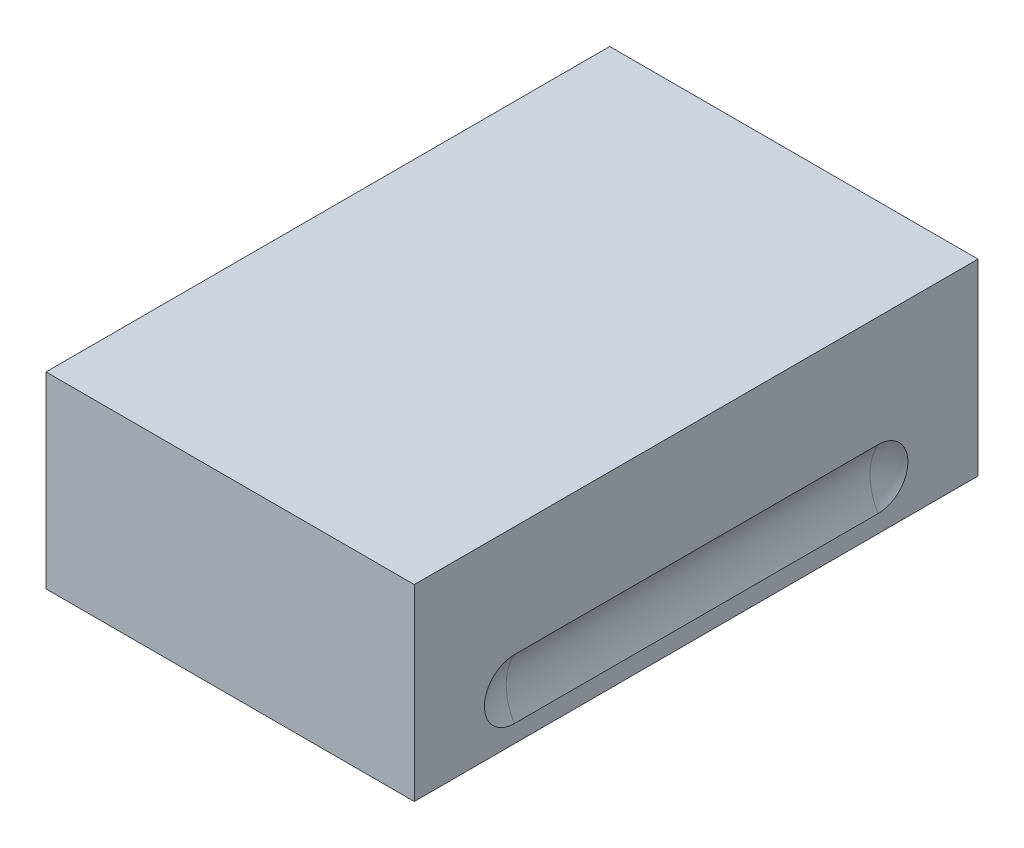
ISO-10303-21;
HEADER;
FILE_DESCRIPTION(('STEP AP214'),'2;1');
FILE_NAME('part.step','',(''),(''),'','','');
FILE_SCHEMA(('AUTOMOTIVE_DESIGN { 1 0 10303 214 1 1 1 1 }'));
ENDSEC;
DATA;
#1=APPLICATION_CONTEXT('core data for automotive mechanical design processes');
#2=APPLICATION_PROTOCOL_DEFINITION('international standard','automotive_design',2000,#1);
#3=PRODUCT_CONTEXT('',#1,'mechanical');
#4=PRODUCT('Part','Part','',(#3));
#5=PRODUCT_RELATED_PRODUCT_CATEGORY('part','',(#4));
#6=PRODUCT_DEFINITION_FORMATION('','',#4);
#7=PRODUCT_DEFINITION_CONTEXT('part definition',#1,'design');
#8=PRODUCT_DEFINITION('design','',#6,#7);
#9=PRODUCT_DEFINITION_SHAPE('','',#8);
#10=(LENGTH_UNIT() NAMED_UNIT(*) SI_UNIT(.MILLI.,.METRE.));
#11=(NAMED_UNIT(*) PLANE_ANGLE_UNIT() SI_UNIT($,.RADIAN.));
#12=(NAMED_UNIT(*) SI_UNIT($,.STERADIAN.) SOLID_ANGLE_UNIT());
#13=UNCERTAINTY_MEASURE_WITH_UNIT(LENGTH_MEASURE(1.E-05),#10,'distance_accuracy_value','');
#14=(GEOMETRIC_REPRESENTATION_CONTEXT(3) GLOBAL_UNCERTAINTY_ASSIGNED_CONTEXT((#13)) GLOBAL_UNIT_ASSIGNED_CONTEXT((#10,
#11,#12)) REPRESENTATION_CONTEXT('',''));
#15=CARTESIAN_POINT('',(0.,0.,0.));
#16=DIRECTION('',(0.,0.,1.));
#17=DIRECTION('',(1.,0.,0.));
#18=AXIS2_PLACEMENT_3D('',#15,#16,#17);
#19=CARTESIAN_POINT('',(0.,58.5,-87.5));
#20=DIRECTION('',(0.,1.,0.));
#21=DIRECTION('',(0.,0.,1.));
#22=AXIS2_PLACEMENT_3D('',#19,#20,#21);
#23=PLANE('',#22);
#24=DIRECTION('',(0.,0.,1.));
#25=VECTOR('',#24,1.);
#26=CARTESIAN_POINT('',(-8.25,58.5,-64.5));
#27=LINE('',#26,#25);
#28=CARTESIAN_POINT('',(-8.25,58.5,-64.5));
#29=VERTEX_POINT('',#28);
#30=CARTESIAN_POINT('',(-8.25,58.5,-110.5));
#31=VERTEX_POINT('',#30);
#32=EDGE_CURVE('E273',#29,#31,#27,.F.);
#33=ORIENTED_EDGE('',*,*,#32,.T.);
#34=DIRECTION('',(-1.,0.,0.));
#35=VECTOR('',#34,1.);
#36=CARTESIAN_POINT('',(-8.25,58.5,-110.5));
#37=LINE('',#36,#35);
#38=CARTESIAN_POINT('',(8.25,58.5,-110.5));
#39=VERTEX_POINT('',#38);
#40=EDGE_CURVE('E272',#31,#39,#37,.F.);
#41=ORIENTED_EDGE('',*,*,#40,.T.);
#42=DIRECTION('',(0.,0.,-1.));
#43=VECTOR('',#42,1.);
#44=CARTESIAN_POINT('',(8.25,58.5,-110.5));
#45=LINE('',#44,#43);
#46=CARTESIAN_POINT('',(8.25,58.5,-64.5));
#47=VERTEX_POINT('',#46);
#48=EDGE_CURVE('E280',#39,#47,#45,.F.);
#49=ORIENTED_EDGE('',*,*,#48,.T.);
#50=DIRECTION('',(1.,0.,0.));
#51=VECTOR('',#50,1.);
#52=CARTESIAN_POINT('',(8.25,58.5,-64.5));
#53=LINE('',#52,#51);
#54=EDGE_CURVE('E285',#47,#29,#53,.F.);
#55=ORIENTED_EDGE('',*,*,#54,.T.);
#56=EDGE_LOOP('',(#33,#41,#49,#55));
#57=FACE_BOUND('',#56,.T.);
#58=ADVANCED_FACE('F14',(#57),#23,.F.);
#59=CARTESIAN_POINT('',(-8.25,50.,-64.5));
#60=DIRECTION('',(-1.,0.,0.));
#61=DIRECTION('',(0.,0.,1.));
#62=AXIS2_PLACEMENT_3D('',#59,#60,#61);
#63=PLANE('',#62);
#64=DIRECTION('',(0.,1.,0.));
#65=VECTOR('',#64,1.);
#66=CARTESIAN_POINT('',(-8.25,50.,-110.5));
#67=LINE('',#66,#65);
#68=CARTESIAN_POINT('',(-8.25,50.,-110.5));
#69=VERTEX_POINT('',#68);
#70=EDGE_CURVE('E264',#69,#31,#67,.T.);
#71=ORIENTED_EDGE('',*,*,#70,.T.);
#72=ORIENTED_EDGE('',*,*,#32,.F.);
#73=DIRECTION('',(0.,1.,0.));
#74=VECTOR('',#73,1.);
#75=CARTESIAN_POINT('',(-8.25,50.,-64.5));
#76=LINE('',#75,#74);
#77=CARTESIAN_POINT('',(-8.25,50.,-64.5));
#78=VERTEX_POINT('',#77);
#79=EDGE_CURVE('E80',#29,#78,#76,.F.);
#80=ORIENTED_EDGE('',*,*,#79,.T.);
#81=DIRECTION('',(0.,0.,1.));
#82=VECTOR('',#81,1.);
#83=CARTESIAN_POINT('',(-8.25,50.,-87.5));
#84=LINE('',#83,#82);
#85=EDGE_CURVE('E220',#78,#69,#84,.F.);
#86=ORIENTED_EDGE('',*,*,#85,.T.);
#87=EDGE_LOOP('',(#71,#72,#80,#86));
#88=FACE_BOUND('',#87,.T.);
#89=ADVANCED_FACE('F261',(#88),#63,.F.);
#90=CARTESIAN_POINT('',(-8.25,50.,-110.5));
#91=DIRECTION('',(0.,0.,-1.));
#92=DIRECTION('',(-1.,0.,0.));
#93=AXIS2_PLACEMENT_3D('',#90,#91,#92);
#94=PLANE('',#93);
#95=DIRECTION('',(0.,1.,0.));
#96=VECTOR('',#95,1.);
#97=CARTESIAN_POINT('',(8.25,50.,-110.5));
#98=LINE('',#97,#96);
#99=CARTESIAN_POINT('',(8.25,50.,-110.5));
#100=VERTEX_POINT('',#99);
#101=EDGE_CURVE('E275',#100,#39,#98,.T.);
#102=ORIENTED_EDGE('',*,*,#101,.T.);
#103=ORIENTED_EDGE('',*,*,#40,.F.);
#104=ORIENTED_EDGE('',*,*,#70,.F.);
#105=DIRECTION('',(1.,0.,0.));
#106=VECTOR('',#105,1.);
#107=CARTESIAN_POINT('',(0.,50.,-110.5));
#108=LINE('',#107,#106);
#109=EDGE_CURVE('E223',#69,#100,#108,.T.);
#110=ORIENTED_EDGE('',*,*,#109,.T.);
#111=EDGE_LOOP('',(#102,#103,#104,#110));
#112=FACE_BOUND('',#111,.T.);
#113=ADVANCED_FACE('F270',(#112),#94,.F.);
#114=CARTESIAN_POINT('',(8.25,50.,-110.5));
#115=DIRECTION('',(1.,0.,0.));
#116=DIRECTION('',(0.,0.,-1.));
#117=AXIS2_PLACEMENT_3D('',#114,#115,#116);
#118=PLANE('',#117);
#119=DIRECTION('',(0.,1.,0.));
#120=VECTOR('',#119,1.);
#121=CARTESIAN_POINT('',(8.25,50.,-64.5));
#122=LINE('',#121,#120);
#123=CARTESIAN_POINT('',(8.25,50.,-64.5));
#124=VERTEX_POINT('',#123);
#125=EDGE_CURVE('E252',#124,#47,#122,.T.);
#126=ORIENTED_EDGE('',*,*,#125,.T.);
#127=ORIENTED_EDGE('',*,*,#48,.F.);
#128=ORIENTED_EDGE('',*,*,#101,.F.);
#129=DIRECTION('',(0.,0.,1.));
#130=VECTOR('',#129,1.);
#131=CARTESIAN_POINT('',(8.25,50.,-87.5));
#132=LINE('',#131,#130);
#133=EDGE_CURVE('E235',#100,#124,#132,.T.);
#134=ORIENTED_EDGE('',*,*,#133,.T.);
#135=EDGE_LOOP('',(#126,#127,#128,#134));
#136=FACE_BOUND('',#135,.T.);
#137=ADVANCED_FACE('F291',(#136),#118,.F.);
#138=CARTESIAN_POINT('',(8.25,50.,-64.5));
#139=DIRECTION('',(0.,0.,1.));
#140=DIRECTION('',(1.,0.,0.));
#141=AXIS2_PLACEMENT_3D('',#138,#139,#140);
#142=PLANE('',#141);
#143=ORIENTED_EDGE('',*,*,#79,.F.);
#144=ORIENTED_EDGE('',*,*,#54,.F.);
#145=ORIENTED_EDGE('',*,*,#125,.F.);
#146=DIRECTION('',(1.,0.,0.));
#147=VECTOR('',#146,1.);
#148=CARTESIAN_POINT('',(0.,50.,-64.5));
#149=LINE('',#148,#147);
#150=EDGE_CURVE('E93',#124,#78,#149,.F.);
#151=ORIENTED_EDGE('',*,*,#150,.T.);
#152=EDGE_LOOP('',(#143,#144,#145,#151));
#153=FACE_BOUND('',#152,.T.);
#154=ADVANCED_FACE('F248',(#153),#142,.F.);
#155=CARTESIAN_POINT('',(31.3299999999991,56.3,-63.2999999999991));
#156=DIRECTION('',(0.880737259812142,0.442113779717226,0.169815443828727));
#157=DIRECTION('',(0.469386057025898,-0.767096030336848,-0.437310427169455));
#158=AXIS2_PLACEMENT_3D('',#155,#156,#157);
#159=SPHERICAL_SURFACE('',#158,7.9);
#160=CARTESIAN_POINT('',(31.33,56.3,-63.3));
#161=DIRECTION('',(0.,0.,-1.));
#162=DIRECTION('',(-1.,0.,0.));
#163=AXIS2_PLACEMENT_3D('',#160,#161,#162);
#164=CIRCLE('',#163,7.9);
#165=CARTESIAN_POINT('',(24.5,52.3299748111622,-63.3));
#166=VERTEX_POINT('',#165);
#167=CARTESIAN_POINT('',(24.5,60.270025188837,-63.3));
#168=VERTEX_POINT('',#167);
#169=EDGE_CURVE('E18',#166,#168,#164,.T.);
#170=ORIENTED_EDGE('',*,*,#169,.T.);
#171=CARTESIAN_POINT('',(24.5,52.3299748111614,-63.3));
#172=CARTESIAN_POINT('',(24.5,52.32996411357,-63.188339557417));
#173=CARTESIAN_POINT('',(24.5,52.3346855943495,-63.0766841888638));
#174=CARTESIAN_POINT('',(24.5,52.3535101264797,-62.85417227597));
#175=CARTESIAN_POINT('',(24.5,52.3676127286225,-62.7433156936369));
#176=CARTESIAN_POINT('',(24.5,52.4051035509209,-62.5232565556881));
#177=CARTESIAN_POINT('',(24.5,52.4284852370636,-62.414052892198));
#178=CARTESIAN_POINT('',(24.5,52.4843445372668,-62.1980301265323));
#179=CARTESIAN_POINT('',(24.5,52.5168220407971,-62.0912109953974));
#180=CARTESIAN_POINT('',(24.5,52.627634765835,-61.775364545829));
#181=CARTESIAN_POINT('',(24.5,52.7193661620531,-61.5708549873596));
#182=CARTESIAN_POINT('',(24.5,52.9357981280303,-61.1802936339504));
#183=CARTESIAN_POINT('',(24.5,53.0604922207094,-60.9942382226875));
#184=CARTESIAN_POINT('',(24.5,53.339358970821,-60.6456655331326));
#185=CARTESIAN_POINT('',(24.5,53.493532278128,-60.4831487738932));
#186=CARTESIAN_POINT('',(24.5,53.8269954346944,-60.1862886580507));
#187=CARTESIAN_POINT('',(24.5,54.0062891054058,-60.0519495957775));
#188=CARTESIAN_POINT('',(24.5,54.3848790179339,-59.8152846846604));
#189=CARTESIAN_POINT('',(24.5,54.5841743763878,-59.7129574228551));
#190=CARTESIAN_POINT('',(24.5,54.9971025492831,-59.5432212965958));
#191=CARTESIAN_POINT('',(24.5,55.210734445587,-59.4758101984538));
#192=CARTESIAN_POINT('',(24.5,55.6462877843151,-59.3778081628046));
#193=CARTESIAN_POINT('',(24.5,55.8682093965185,-59.3472179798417));
#194=CARTESIAN_POINT('',(24.5,56.3140435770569,-59.3237286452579));
#195=CARTESIAN_POINT('',(24.5,56.5379561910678,-59.3308303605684));
#196=CARTESIAN_POINT('',(24.5,56.981408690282,-59.3825247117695));
#197=CARTESIAN_POINT('',(24.5,57.2009486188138,-59.4271169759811));
#198=CARTESIAN_POINT('',(24.5,57.6294255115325,-59.5525266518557));
#199=CARTESIAN_POINT('',(24.5,57.8383625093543,-59.6333439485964));
#200=CARTESIAN_POINT('',(24.5,58.2397074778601,-59.8289092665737));
#201=CARTESIAN_POINT('',(24.5,58.4321150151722,-59.943658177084));
#202=CARTESIAN_POINT('',(24.5,58.7949275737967,-60.2038324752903));
#203=CARTESIAN_POINT('',(24.5,58.9653336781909,-60.3492563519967));
#204=CARTESIAN_POINT('',(24.5,59.2792822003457,-60.6665954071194));
#205=CARTESIAN_POINT('',(24.5,59.4228282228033,-60.8385070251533));
#206=CARTESIAN_POINT('',(24.5,59.679104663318,-61.2041616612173));
#207=CARTESIAN_POINT('',(24.5,59.7918252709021,-61.3979116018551));
#208=CARTESIAN_POINT('',(24.5,59.9352824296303,-61.7005119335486));
#209=CARTESIAN_POINT('',(24.5,59.9788567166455,-61.8034663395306));
#210=CARTESIAN_POINT('',(24.5,60.0571708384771,-62.0126704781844));
#211=CARTESIAN_POINT('',(24.5,60.0919139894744,-62.1189189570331));
#212=CARTESIAN_POINT('',(24.5,60.1522829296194,-62.3338378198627));
#213=CARTESIAN_POINT('',(24.5,60.1779187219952,-62.4425054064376));
#214=CARTESIAN_POINT('',(24.5,60.2199409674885,-62.6615720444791));
#215=CARTESIAN_POINT('',(24.5,60.2363319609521,-62.7719702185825));
#216=CARTESIAN_POINT('',(24.5,60.2553736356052,-62.9521737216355));
#217=CARTESIAN_POINT('',(24.5,60.260871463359,-63.02169076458));
#218=CARTESIAN_POINT('',(24.5,60.2681945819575,-63.1608027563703));
#219=CARTESIAN_POINT('',(24.5,60.27002592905,-63.230397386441));
#220=CARTESIAN_POINT('',(24.5,60.2700251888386,-63.3));
#221=B_SPLINE_CURVE_WITH_KNOTS('',3,(#171,#172,#173,#174,#175,#176,#177,#178,#179,#180,#181,
#182,#183,#184,#185,#186,#187,#188,#189,#190,#191,#192,#193,#194,#195,#196,#197,#198,#199,#200,
#201,#202,#203,#204,#205,#206,#207,#208,#209,#210,#211,#212,#213,#214,#215,#216,#217,#218,#219,
#220),.UNSPECIFIED.,.F.,.F.,(4,2,2,2,2,2,2,2,2,2,2,2,2,2,2,2,2,2,2,2,2,2,2,2,4),(0.,
0.334872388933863,0.66972874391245,1.00434972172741,1.33896663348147,2.00792040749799,
2.6767428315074,3.34558000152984,4.01451902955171,4.68342852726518,5.3522952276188,
6.02117563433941,6.69007142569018,7.35896058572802,8.02784762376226,8.69675219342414,
9.36562382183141,10.0344056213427,10.7034000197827,11.0384618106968,11.3733975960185,
11.7079643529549,12.0423666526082,12.2514802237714,12.4602480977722),.UNSPECIFIED.);
#222=EDGE_CURVE('E77',#166,#168,#221,.T.);
#223=ORIENTED_EDGE('',*,*,#222,.F.);
#224=EDGE_LOOP('',(#170,#223));
#225=FACE_BOUND('',#224,.T.);
#226=ADVANCED_FACE('F75',(#225),#159,.F.);
#227=CARTESIAN_POINT('',(31.33,56.3,-87.5));
#228=DIRECTION('',(0.,0.,-1.));
#229=DIRECTION('',(-1.,0.,0.));
#230=AXIS2_PLACEMENT_3D('',#227,#228,#229);
#231=CYLINDRICAL_SURFACE('',#230,7.9);
#232=ORIENTED_EDGE('',*,*,#169,.F.);
#233=DIRECTION('',(0.,0.,-1.));
#234=VECTOR('',#233,1.);
#235=CARTESIAN_POINT('',(24.5,52.329974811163,-125.));
#236=LINE('',#235,#234);
#237=CARTESIAN_POINT('',(24.5,52.329974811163,-111.7));
#238=VERTEX_POINT('',#237);
#239=EDGE_CURVE('E91',#238,#166,#236,.F.);
#240=ORIENTED_EDGE('',*,*,#239,.F.);
#241=CARTESIAN_POINT('',(31.33,56.3,-111.7));
#242=DIRECTION('',(0.,0.,-1.));
#243=DIRECTION('',(-1.,0.,0.));
#244=AXIS2_PLACEMENT_3D('',#241,#242,#243);
#245=CIRCLE('',#244,7.9);
#246=CARTESIAN_POINT('',(24.5,60.2700251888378,-111.7));
#247=VERTEX_POINT('',#246);
#248=EDGE_CURVE('E79',#238,#247,#245,.T.);
#249=ORIENTED_EDGE('',*,*,#248,.T.);
#250=DIRECTION('',(0.,0.,-1.));
#251=VECTOR('',#250,1.);
#252=CARTESIAN_POINT('',(24.5,60.270025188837,-125.));
#253=LINE('',#252,#251);
#254=EDGE_CURVE('E82',#168,#247,#253,.T.);
#255=ORIENTED_EDGE('',*,*,#254,.F.);
#256=EDGE_LOOP('',(#232,#240,#249,#255));
#257=FACE_BOUND('',#256,.T.);
#258=ADVANCED_FACE('F83',(#257),#231,.F.);
#259=CARTESIAN_POINT('',(31.3299999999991,56.3,-111.7));
#260=DIRECTION('',(0.880737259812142,0.442113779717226,0.169815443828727));
#261=DIRECTION('',(0.469386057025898,-0.767096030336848,-0.437310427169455));
#262=AXIS2_PLACEMENT_3D('',#259,#260,#261);
#263=SPHERICAL_SURFACE('',#262,7.9);
#264=CARTESIAN_POINT('',(24.3721756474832,52.8073011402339,-113.041542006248));
#265=VERTEX_POINT('',#264);
#266=VERTEX_LOOP('',#265);
#267=FACE_BOUND('',#266,.T.);
#268=ORIENTED_EDGE('',*,*,#248,.F.);
#269=CARTESIAN_POINT('',(24.5,60.2700251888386,-111.7));
#270=CARTESIAN_POINT('',(24.5,60.2700358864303,-111.811660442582));
#271=CARTESIAN_POINT('',(24.5,60.2653144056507,-111.923315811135));
#272=CARTESIAN_POINT('',(24.5,60.2464898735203,-112.145827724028));
#273=CARTESIAN_POINT('',(24.5,60.2323872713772,-112.256684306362));
#274=CARTESIAN_POINT('',(24.5,60.1948964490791,-112.476743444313));
#275=CARTESIAN_POINT('',(24.5,60.1715147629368,-112.585947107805));
#276=CARTESIAN_POINT('',(24.5,60.1156554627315,-112.801969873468));
#277=CARTESIAN_POINT('',(24.5,60.083177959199,-112.908789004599));
#278=CARTESIAN_POINT('',(24.5,59.9723652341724,-113.22463545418));
#279=CARTESIAN_POINT('',(24.5,59.8806338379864,-113.429145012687));
#280=CARTESIAN_POINT('',(24.5,59.6642018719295,-113.819706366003));
#281=CARTESIAN_POINT('',(24.5,59.5395077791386,-114.005761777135));
#282=CARTESIAN_POINT('',(24.5,59.260641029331,-114.354334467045));
#283=CARTESIAN_POINT('',(24.5,59.1064677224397,-114.516851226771));
#284=CARTESIAN_POINT('',(24.5,58.7730045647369,-114.813711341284));
#285=CARTESIAN_POINT('',(24.5,58.593710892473,-114.948050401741));
#286=CARTESIAN_POINT('',(24.5,58.2151209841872,-115.184715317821));
#287=CARTESIAN_POINT('',(24.5,58.0158256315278,-115.287042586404));
#288=CARTESIAN_POINT('',(24.5,57.6028974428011,-115.456778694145));
#289=CARTESIAN_POINT('',(24.5,57.3892655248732,-115.524189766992));
#290=CARTESIAN_POINT('',(24.5,56.9537122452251,-115.62219187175));
#291=CARTESIAN_POINT('',(24.5,56.7317907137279,-115.652782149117));
#292=CARTESIAN_POINT('',(24.5,56.2859563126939,-115.676271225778));
#293=CARTESIAN_POINT('',(24.5,56.0620433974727,-115.66916915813));
#294=CARTESIAN_POINT('',(24.5,55.6185917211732,-115.617475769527));
#295=CARTESIAN_POINT('',(24.5,55.3990529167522,-115.572884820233));
#296=CARTESIAN_POINT('',(24.5,54.9705729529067,-115.447471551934));
#297=CARTESIAN_POINT('',(24.5,54.761631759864,-115.366649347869));
#298=CARTESIAN_POINT('',(24.5,54.3602982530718,-115.171097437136));
#299=CARTESIAN_POINT('',(24.5,54.1679063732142,-115.056366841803));
#300=CARTESIAN_POINT('',(24.5,53.8050510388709,-114.796142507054));
#301=CARTESIAN_POINT('',(24.5,53.6345865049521,-114.650650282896));
#302=CARTESIAN_POINT('',(24.5,53.3991587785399,-114.412699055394));
#303=CARTESIAN_POINT('',(24.5,53.3240319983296,-114.330055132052));
#304=CARTESIAN_POINT('',(24.5,53.1810045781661,-114.158738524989));
#305=CARTESIAN_POINT('',(24.5,53.1131019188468,-114.070067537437));
#306=CARTESIAN_POINT('',(24.5,52.9850136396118,-113.887332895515));
#307=CARTESIAN_POINT('',(24.5,52.9248270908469,-113.793269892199));
#308=CARTESIAN_POINT('',(24.5,52.8406370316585,-113.648592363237));
#309=CARTESIAN_POINT('',(24.5,52.8135771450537,-113.599745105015));
#310=CARTESIAN_POINT('',(24.5,52.7615206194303,-113.50095059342));
#311=CARTESIAN_POINT('',(24.5,52.7365257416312,-113.451002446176));
#312=CARTESIAN_POINT('',(24.5,52.5222213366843,-112.998546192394));
#313=CARTESIAN_POINT('',(24.5,52.3988762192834,-112.559553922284));
#314=CARTESIAN_POINT('',(24.5,52.3445914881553,-112.047758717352));
#315=CARTESIAN_POINT('',(24.5,52.3391111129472,-111.978275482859));
#316=CARTESIAN_POINT('',(24.5,52.3318228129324,-111.839230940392));
#317=CARTESIAN_POINT('',(24.5,52.3300088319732,-111.769669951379));
#318=CARTESIAN_POINT('',(24.5,52.3299748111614,-111.7));
#319=B_SPLINE_CURVE_WITH_KNOTS('',3,(#269,#270,#271,#272,#273,#274,#275,#276,#277,#278,#279,
#280,#281,#282,#283,#284,#285,#286,#287,#288,#289,#290,#291,#292,#293,#294,#295,#296,#297,#298,
#299,#300,#301,#302,#303,#304,#305,#306,#307,#308,#309,#310,#311,#312,#313,#314,#315,#316,#317,
#318),.UNSPECIFIED.,.F.,.F.,(4,2,2,2,2,2,2,2,2,2,2,2,2,2,2,2,2,2,2,2,2,2,2,2,4),(0.,
0.334872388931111,0.669728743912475,1.00434972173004,1.33896663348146,2.00792040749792,
2.67674283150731,3.3455800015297,4.01451902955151,4.68342852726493,5.35229522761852,
6.02117563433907,6.69007142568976,7.35896058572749,8.02784762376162,8.69675219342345,
9.36562382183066,9.70035909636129,10.0350005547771,10.369601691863,10.5370626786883,
10.7046650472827,12.0376858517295,12.2467994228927,12.4555672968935),.UNSPECIFIED.);
#320=EDGE_CURVE('E88',#247,#238,#319,.T.);
#321=ORIENTED_EDGE('',*,*,#320,.F.);
#322=EDGE_LOOP('',(#268,#321));
#323=FACE_BOUND('',#322,.T.);
#324=ADVANCED_FACE('F154',(#267,#323),#263,.F.);
#325=CARTESIAN_POINT('',(-31.3299999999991,56.3,-111.7));
#326=DIRECTION('',(0.880737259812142,0.442113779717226,0.169815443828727));
#327=DIRECTION('',(0.469386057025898,-0.767096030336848,-0.437310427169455));
#328=AXIS2_PLACEMENT_3D('',#325,#326,#327);
#329=SPHERICAL_SURFACE('',#328,7.9);
#330=CARTESIAN_POINT('',(-31.33,56.3,-111.7));
#331=DIRECTION('',(0.,0.,1.));
#332=DIRECTION('',(1.,0.,0.));
#333=AXIS2_PLACEMENT_3D('',#330,#331,#332);
#334=CIRCLE('',#333,7.9);
#335=CARTESIAN_POINT('',(-24.5,52.3299748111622,-111.7));
#336=VERTEX_POINT('',#335);
#337=CARTESIAN_POINT('',(-24.5,60.270025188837,-111.7));
#338=VERTEX_POINT('',#337);
#339=EDGE_CURVE('E221',#336,#338,#334,.T.);
#340=ORIENTED_EDGE('',*,*,#339,.T.);
#341=CARTESIAN_POINT('',(-24.5,52.3299748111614,-111.7));
#342=CARTESIAN_POINT('',(-24.5,52.32996411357,-111.811660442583));
#343=CARTESIAN_POINT('',(-24.5,52.3346855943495,-111.923315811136));
#344=CARTESIAN_POINT('',(-24.5,52.3535101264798,-112.14582772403));
#345=CARTESIAN_POINT('',(-24.5,52.3676127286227,-112.256684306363));
#346=CARTESIAN_POINT('',(-24.5,52.4051035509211,-112.476743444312));
#347=CARTESIAN_POINT('',(-24.5,52.4284852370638,-112.585947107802));
#348=CARTESIAN_POINT('',(-24.5,52.484344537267,-112.801969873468));
#349=CARTESIAN_POINT('',(-24.5,52.5168220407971,-112.908789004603));
#350=CARTESIAN_POINT('',(-24.5,52.6276347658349,-113.224635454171));
#351=CARTESIAN_POINT('',(-24.5,52.7193661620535,-113.42914501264));
#352=CARTESIAN_POINT('',(-24.5,52.9357981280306,-113.819706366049));
#353=CARTESIAN_POINT('',(-24.5,53.0604922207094,-114.005761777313));
#354=CARTESIAN_POINT('',(-24.5,53.3393589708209,-114.354334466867));
#355=CARTESIAN_POINT('',(-24.5,53.4935322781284,-114.516851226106));
#356=CARTESIAN_POINT('',(-24.5,53.8269954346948,-114.813711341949));
#357=CARTESIAN_POINT('',(-24.5,54.0062891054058,-114.948050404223));
#358=CARTESIAN_POINT('',(-24.5,54.3848790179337,-115.18471531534));
#359=CARTESIAN_POINT('',(-24.5,54.584174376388,-115.287042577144));
#360=CARTESIAN_POINT('',(-24.5,54.9971025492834,-115.456778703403));
#361=CARTESIAN_POINT('',(-24.5,55.2107344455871,-115.524189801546));
#362=CARTESIAN_POINT('',(-24.5,55.646287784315,-115.622191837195));
#363=CARTESIAN_POINT('',(-24.5,55.8682093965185,-115.652782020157));
#364=CARTESIAN_POINT('',(-24.5,56.314043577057,-115.676271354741));
#365=CARTESIAN_POINT('',(-24.5,56.5379561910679,-115.669169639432));
#366=CARTESIAN_POINT('',(-24.5,56.9814086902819,-115.61747528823));
#367=CARTESIAN_POINT('',(-24.5,57.2009486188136,-115.572883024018));
#368=CARTESIAN_POINT('',(-24.5,57.6294255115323,-115.447473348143));
#369=CARTESIAN_POINT('',(-24.5,57.8383625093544,-115.366656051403));
#370=CARTESIAN_POINT('',(-24.5,58.23970747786,-115.171090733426));
#371=CARTESIAN_POINT('',(-24.5,58.4321150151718,-115.056341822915));
#372=CARTESIAN_POINT('',(-24.5,58.7949275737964,-114.796167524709));
#373=CARTESIAN_POINT('',(-24.5,58.9653336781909,-114.650743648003));
#374=CARTESIAN_POINT('',(-24.5,59.2792822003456,-114.333404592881));
#375=CARTESIAN_POINT('',(-24.5,59.4228282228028,-114.161492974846));
#376=CARTESIAN_POINT('',(-24.5,59.6791046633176,-113.795838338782));
#377=CARTESIAN_POINT('',(-24.5,59.7918252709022,-113.602088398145));
#378=CARTESIAN_POINT('',(-24.5,59.9352824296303,-113.299488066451));
#379=CARTESIAN_POINT('',(-24.5,59.9788567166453,-113.196533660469));
#380=CARTESIAN_POINT('',(-24.5,60.0571708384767,-112.987329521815));
#381=CARTESIAN_POINT('',(-24.5,60.0919139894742,-112.881081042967));
#382=CARTESIAN_POINT('',(-24.5,60.1522829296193,-112.666162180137));
#383=CARTESIAN_POINT('',(-24.5,60.177918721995,-112.557494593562));
#384=CARTESIAN_POINT('',(-24.5,60.2199409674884,-112.338427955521));
#385=CARTESIAN_POINT('',(-24.5,60.2363319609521,-112.228029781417));
#386=CARTESIAN_POINT('',(-24.5,60.2553736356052,-112.047826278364));
#387=CARTESIAN_POINT('',(-24.5,60.260871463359,-111.97830923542));
#388=CARTESIAN_POINT('',(-24.5,60.2681945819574,-111.83919724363));
#389=CARTESIAN_POINT('',(-24.5,60.2700259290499,-111.769602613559));
#390=CARTESIAN_POINT('',(-24.5,60.2700251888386,-111.7));
#391=B_SPLINE_CURVE_WITH_KNOTS('',3,(#341,#342,#343,#344,#345,#346,#347,#348,#349,#350,#351,
#352,#353,#354,#355,#356,#357,#358,#359,#360,#361,#362,#363,#364,#365,#366,#367,#368,#369,#370,
#371,#372,#373,#374,#375,#376,#377,#378,#379,#380,#381,#382,#383,#384,#385,#386,#387,#388,#389,
#390),.UNSPECIFIED.,.F.,.F.,(4,2,2,2,2,2,2,2,2,2,2,2,2,2,2,2,2,2,2,2,2,2,2,2,4),(0.,
0.334872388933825,0.669728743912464,1.00434972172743,1.33896663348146,2.00792040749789,
2.67674283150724,3.34558000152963,4.01451902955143,4.68342852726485,5.35229522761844,
6.02117563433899,6.69007142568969,7.35896058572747,8.02784762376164,8.69675219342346,
9.36562382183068,10.0344056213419,10.7034000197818,11.0384618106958,11.3733975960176,
11.707964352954,12.0423666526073,12.2514802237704,12.4602480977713),.UNSPECIFIED.);
#392=EDGE_CURVE('E139',#336,#338,#391,.T.);
#393=ORIENTED_EDGE('',*,*,#392,.F.);
#394=EDGE_LOOP('',(#340,#393));
#395=FACE_BOUND('',#394,.T.);
#396=ADVANCED_FACE('F148',(#395),#329,.F.);
#397=CARTESIAN_POINT('',(-31.33,56.3,-87.5));
#398=DIRECTION('',(0.,0.,1.));
#399=DIRECTION('',(1.,0.,0.));
#400=AXIS2_PLACEMENT_3D('',#397,#398,#399);
#401=CYLINDRICAL_SURFACE('',#400,7.9);
#402=ORIENTED_EDGE('',*,*,#339,.F.);
#403=DIRECTION('',(0.,0.,1.));
#404=VECTOR('',#403,1.);
#405=CARTESIAN_POINT('',(-24.5,52.329974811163,-50.));
#406=LINE('',#405,#404);
#407=CARTESIAN_POINT('',(-24.5,52.329974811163,-63.3));
#408=VERTEX_POINT('',#407);
#409=EDGE_CURVE('E147',#408,#336,#406,.F.);
#410=ORIENTED_EDGE('',*,*,#409,.F.);
#411=CARTESIAN_POINT('',(-31.33,56.3,-63.3));
#412=DIRECTION('',(0.,0.,1.));
#413=DIRECTION('',(1.,0.,0.));
#414=AXIS2_PLACEMENT_3D('',#411,#412,#413);
#415=CIRCLE('',#414,7.9);
#416=CARTESIAN_POINT('',(-24.5,60.2700251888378,-63.3));
#417=VERTEX_POINT('',#416);
#418=EDGE_CURVE('E109',#408,#417,#415,.T.);
#419=ORIENTED_EDGE('',*,*,#418,.T.);
#420=DIRECTION('',(0.,0.,1.));
#421=VECTOR('',#420,1.);
#422=CARTESIAN_POINT('',(-24.5,60.270025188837,-50.));
#423=LINE('',#422,#421);
#424=EDGE_CURVE('E146',#338,#417,#423,.T.);
#425=ORIENTED_EDGE('',*,*,#424,.F.);
#426=EDGE_LOOP('',(#402,#410,#419,#425));
#427=FACE_BOUND('',#426,.T.);
#428=ADVANCED_FACE('F153',(#427),#401,.F.);
#429=CARTESIAN_POINT('',(-31.3299999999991,56.3,-63.2999999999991));
#430=DIRECTION('',(0.880737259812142,0.442113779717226,0.169815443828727));
#431=DIRECTION('',(0.469386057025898,-0.767096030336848,-0.437310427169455));
#432=AXIS2_PLACEMENT_3D('',#429,#430,#431);
#433=SPHERICAL_SURFACE('',#432,7.9);
#434=CARTESIAN_POINT('',(-24.3721756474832,59.7926988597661,-61.9584579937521));
#435=VERTEX_POINT('',#434);
#436=VERTEX_LOOP('',#435);
#437=FACE_BOUND('',#436,.T.);
#438=ORIENTED_EDGE('',*,*,#418,.F.);
#439=CARTESIAN_POINT('',(-24.5,60.2700251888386,-63.3));
#440=CARTESIAN_POINT('',(-24.5,60.2700358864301,-63.188339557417));
#441=CARTESIAN_POINT('',(-24.5,60.2653144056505,-63.0766841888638));
#442=CARTESIAN_POINT('',(-24.5,60.2464898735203,-62.85417227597));
#443=CARTESIAN_POINT('',(-24.5,60.2323872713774,-62.7433156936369));
#444=CARTESIAN_POINT('',(-24.5,60.1948964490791,-62.5232565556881));
#445=CARTESIAN_POINT('',(-24.5,60.1715147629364,-62.414052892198));
#446=CARTESIAN_POINT('',(-24.5,60.1156554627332,-62.1980301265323));
#447=CARTESIAN_POINT('',(-24.5,60.083177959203,-62.0912109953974));
#448=CARTESIAN_POINT('',(-24.5,59.972365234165,-61.775364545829));
#449=CARTESIAN_POINT('',(-24.5,59.8806338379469,-61.5708549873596));
#450=CARTESIAN_POINT('',(-24.5,59.6642018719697,-61.1802936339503));
#451=CARTESIAN_POINT('',(-24.5,59.5395077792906,-60.9942382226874));
#452=CARTESIAN_POINT('',(-24.5,59.260641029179,-60.6456655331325));
#453=CARTESIAN_POINT('',(-24.5,59.1064677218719,-60.4831487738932));
#454=CARTESIAN_POINT('',(-24.5,58.7730045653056,-60.1862886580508));
#455=CARTESIAN_POINT('',(-24.5,58.5937108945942,-60.0519495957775));
#456=CARTESIAN_POINT('',(-24.5,58.2151209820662,-59.8152846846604));
#457=CARTESIAN_POINT('',(-24.5,58.0158256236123,-59.7129574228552));
#458=CARTESIAN_POINT('',(-24.5,57.6028974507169,-59.5432212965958));
#459=CARTESIAN_POINT('',(-24.5,57.389265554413,-59.4758101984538));
#460=CARTESIAN_POINT('',(-24.5,56.9537122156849,-59.3778081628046));
#461=CARTESIAN_POINT('',(-24.5,56.7317906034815,-59.3472179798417));
#462=CARTESIAN_POINT('',(-24.5,56.285956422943,-59.3237286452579));
#463=CARTESIAN_POINT('',(-24.5,56.0620438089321,-59.3308303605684));
#464=CARTESIAN_POINT('',(-24.5,55.6185913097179,-59.3825247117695));
#465=CARTESIAN_POINT('',(-24.5,55.3990513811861,-59.4271169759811));
#466=CARTESIAN_POINT('',(-24.5,54.9705744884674,-59.5525266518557));
#467=CARTESIAN_POINT('',(-24.5,54.7616374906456,-59.6333439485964));
#468=CARTESIAN_POINT('',(-24.5,54.36029252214,-59.8289092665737));
#469=CARTESIAN_POINT('',(-24.5,54.1678849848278,-59.943658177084));
#470=CARTESIAN_POINT('',(-24.5,53.8050724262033,-60.2038324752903));
#471=CARTESIAN_POINT('',(-24.5,53.6346663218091,-60.3492563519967));
#472=CARTESIAN_POINT('',(-24.5,53.3207177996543,-60.6665954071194));
#473=CARTESIAN_POINT('',(-24.5,53.1771717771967,-60.8385070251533));
#474=CARTESIAN_POINT('',(-24.5,52.920895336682,-61.2041616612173));
#475=CARTESIAN_POINT('',(-24.5,52.8081747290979,-61.3979116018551));
#476=CARTESIAN_POINT('',(-24.5,52.6647175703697,-61.7005119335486));
#477=CARTESIAN_POINT('',(-24.5,52.6211432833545,-61.8034663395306));
#478=CARTESIAN_POINT('',(-24.5,52.542829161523,-62.0126704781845));
#479=CARTESIAN_POINT('',(-24.5,52.5080860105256,-62.1189189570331));
#480=CARTESIAN_POINT('',(-24.5,52.4477170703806,-62.3338378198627));
#481=CARTESIAN_POINT('',(-24.5,52.4220812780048,-62.4425054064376));
#482=CARTESIAN_POINT('',(-24.5,52.3800590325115,-62.6615720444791));
#483=CARTESIAN_POINT('',(-24.5,52.3636680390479,-62.7719702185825));
#484=CARTESIAN_POINT('',(-24.5,52.3446263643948,-62.9521737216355));
#485=CARTESIAN_POINT('',(-24.5,52.339128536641,-63.02169076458));
#486=CARTESIAN_POINT('',(-24.5,52.3318054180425,-63.1608027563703));
#487=CARTESIAN_POINT('',(-24.5,52.32997407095,-63.230397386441));
#488=CARTESIAN_POINT('',(-24.5,52.3299748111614,-63.3));
#489=B_SPLINE_CURVE_WITH_KNOTS('',3,(#439,#440,#441,#442,#443,#444,#445,#446,#447,#448,#449,
#450,#451,#452,#453,#454,#455,#456,#457,#458,#459,#460,#461,#462,#463,#464,#465,#466,#467,#468,
#469,#470,#471,#472,#473,#474,#475,#476,#477,#478,#479,#480,#481,#482,#483,#484,#485,#486,#487,
#488),.UNSPECIFIED.,.F.,.F.,(4,2,2,2,2,2,2,2,2,2,2,2,2,2,2,2,2,2,2,2,2,2,2,2,4),(0.,
0.334872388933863,0.669728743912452,1.00434972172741,1.33896663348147,2.00792040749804,
2.67674283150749,3.34558000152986,4.01451902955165,4.68342852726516,5.35229522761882,
6.02117563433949,6.6900714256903,7.35896058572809,8.02784762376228,8.69675219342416,
9.36562382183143,10.0344056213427,10.7034000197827,11.0384618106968,11.3733975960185,
11.7079643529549,12.0423666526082,12.2514802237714,12.4602480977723),.UNSPECIFIED.);
#490=EDGE_CURVE('E133',#417,#408,#489,.T.);
#491=ORIENTED_EDGE('',*,*,#490,.F.);
#492=EDGE_LOOP('',(#438,#491));
#493=FACE_BOUND('',#492,.T.);
#494=ADVANCED_FACE('F164',(#437,#493),#433,.F.);
#495=CARTESIAN_POINT('',(0.,50.,-87.5));
#496=DIRECTION('',(0.,1.,0.));
#497=DIRECTION('',(0.,0.,1.));
#498=AXIS2_PLACEMENT_3D('',#495,#496,#497);
#499=PLANE('',#498);
#500=DIRECTION('',(0.,0.,-1.));
#501=VECTOR('',#500,1.);
#502=CARTESIAN_POINT('',(24.5,50.,-125.));
#503=LINE('',#502,#501);
#504=CARTESIAN_POINT('',(24.5,50.,-50.));
#505=VERTEX_POINT('',#504);
#506=CARTESIAN_POINT('',(24.5,50.,-125.));
#507=VERTEX_POINT('',#506);
#508=EDGE_CURVE('E230',#505,#507,#503,.T.);
#509=ORIENTED_EDGE('',*,*,#508,.F.);
#510=DIRECTION('',(1.,0.,0.));
#511=VECTOR('',#510,1.);
#512=CARTESIAN_POINT('',(24.5,50.,-50.));
#513=LINE('',#512,#511);
#514=CARTESIAN_POINT('',(-24.5,50.,-50.));
#515=VERTEX_POINT('',#514);
#516=EDGE_CURVE('E197',#515,#505,#513,.T.);
#517=ORIENTED_EDGE('',*,*,#516,.F.);
#518=DIRECTION('',(0.,0.,1.));
#519=VECTOR('',#518,1.);
#520=CARTESIAN_POINT('',(-24.5,50.,-50.));
#521=LINE('',#520,#519);
#522=CARTESIAN_POINT('',(-24.5,50.,-125.));
#523=VERTEX_POINT('',#522);
#524=EDGE_CURVE('E204',#523,#515,#521,.T.);
#525=ORIENTED_EDGE('',*,*,#524,.F.);
#526=DIRECTION('',(-1.,0.,0.));
#527=VECTOR('',#526,1.);
#528=CARTESIAN_POINT('',(-24.5,50.,-125.));
#529=LINE('',#528,#527);
#530=EDGE_CURVE('E226',#507,#523,#529,.T.);
#531=ORIENTED_EDGE('',*,*,#530,.F.);
#532=EDGE_LOOP('',(#509,#517,#525,#531));
#533=FACE_BOUND('',#532,.T.);
#534=ORIENTED_EDGE('',*,*,#133,.F.);
#535=ORIENTED_EDGE('',*,*,#109,.F.);
#536=ORIENTED_EDGE('',*,*,#85,.F.);
#537=ORIENTED_EDGE('',*,*,#150,.F.);
#538=EDGE_LOOP('',(#534,#535,#536,#537));
#539=FACE_BOUND('',#538,.T.);
#540=ADVANCED_FACE('F120',(#533,#539),#499,.F.);
#541=CARTESIAN_POINT('',(24.5,50.,-125.));
#542=DIRECTION('',(1.,0.,0.));
#543=DIRECTION('',(0.,0.,-1.));
#544=AXIS2_PLACEMENT_3D('',#541,#542,#543);
#545=PLANE('',#544);
#546=ORIENTED_EDGE('',*,*,#508,.T.);
#547=DIRECTION('',(0.,1.,0.));
#548=VECTOR('',#547,1.);
#549=CARTESIAN_POINT('',(24.5,50.,-125.));
#550=LINE('',#549,#548);
#551=CARTESIAN_POINT('',(24.5,75.,-125.));
#552=VERTEX_POINT('',#551);
#553=EDGE_CURVE('E211',#552,#507,#550,.F.);
#554=ORIENTED_EDGE('',*,*,#553,.F.);
#555=DIRECTION('',(0.,0.,1.));
#556=VECTOR('',#555,1.);
#557=CARTESIAN_POINT('',(24.5,75.,-87.5));
#558=LINE('',#557,#556);
#559=CARTESIAN_POINT('',(24.5,75.,-50.));
#560=VERTEX_POINT('',#559);
#561=EDGE_CURVE('E192',#560,#552,#558,.F.);
#562=ORIENTED_EDGE('',*,*,#561,.F.);
#563=DIRECTION('',(0.,1.,0.));
#564=VECTOR('',#563,1.);
#565=CARTESIAN_POINT('',(24.5,50.,-50.));
#566=LINE('',#565,#564);
#567=EDGE_CURVE('E195',#505,#560,#566,.T.);
#568=ORIENTED_EDGE('',*,*,#567,.F.);
#569=EDGE_LOOP('',(#546,#554,#562,#568));
#570=FACE_BOUND('',#569,.T.);
#571=ORIENTED_EDGE('',*,*,#254,.T.);
#572=ORIENTED_EDGE('',*,*,#320,.T.);
#573=ORIENTED_EDGE('',*,*,#239,.T.);
#574=ORIENTED_EDGE('',*,*,#222,.T.);
#575=EDGE_LOOP('',(#571,#572,#573,#574));
#576=FACE_BOUND('',#575,.T.);
#577=ADVANCED_FACE('F90',(#570,#576),#545,.T.);
#578=CARTESIAN_POINT('',(-24.5,50.,-125.));
#579=DIRECTION('',(0.,0.,-1.));
#580=DIRECTION('',(-1.,0.,0.));
#581=AXIS2_PLACEMENT_3D('',#578,#579,#580);
#582=PLANE('',#581);
#583=ORIENTED_EDGE('',*,*,#530,.T.);
#584=DIRECTION('',(0.,1.,0.));
#585=VECTOR('',#584,1.);
#586=CARTESIAN_POINT('',(-24.5,50.,-125.));
#587=LINE('',#586,#585);
#588=CARTESIAN_POINT('',(-24.5,75.,-125.));
#589=VERTEX_POINT('',#588);
#590=EDGE_CURVE('E205',#589,#523,#587,.F.);
#591=ORIENTED_EDGE('',*,*,#590,.F.);
#592=DIRECTION('',(1.,0.,0.));
#593=VECTOR('',#592,1.);
#594=CARTESIAN_POINT('',(0.,75.,-125.));
#595=LINE('',#594,#593);
#596=EDGE_CURVE('E189',#552,#589,#595,.F.);
#597=ORIENTED_EDGE('',*,*,#596,.F.);
#598=ORIENTED_EDGE('',*,*,#553,.T.);
#599=EDGE_LOOP('',(#583,#591,#597,#598));
#600=FACE_BOUND('',#599,.T.);
#601=ADVANCED_FACE('F119',(#600),#582,.T.);
#602=CARTESIAN_POINT('',(-24.5,50.,-50.));
#603=DIRECTION('',(-1.,0.,0.));
#604=DIRECTION('',(0.,0.,1.));
#605=AXIS2_PLACEMENT_3D('',#602,#603,#604);
#606=PLANE('',#605);
#607=ORIENTED_EDGE('',*,*,#524,.T.);
#608=DIRECTION('',(0.,1.,0.));
#609=VECTOR('',#608,1.);
#610=CARTESIAN_POINT('',(-24.5,50.,-50.));
#611=LINE('',#610,#609);
#612=CARTESIAN_POINT('',(-24.5,75.,-50.));
#613=VERTEX_POINT('',#612);
#614=EDGE_CURVE('E33',#613,#515,#611,.F.);
#615=ORIENTED_EDGE('',*,*,#614,.F.);
#616=DIRECTION('',(0.,0.,1.));
#617=VECTOR('',#616,1.);
#618=CARTESIAN_POINT('',(-24.5,75.,-87.5));
#619=LINE('',#618,#617);
#620=EDGE_CURVE('E24',#589,#613,#619,.T.);
#621=ORIENTED_EDGE('',*,*,#620,.F.);
#622=ORIENTED_EDGE('',*,*,#590,.T.);
#623=EDGE_LOOP('',(#607,#615,#621,#622));
#624=FACE_BOUND('',#623,.T.);
#625=ORIENTED_EDGE('',*,*,#424,.T.);
#626=ORIENTED_EDGE('',*,*,#490,.T.);
#627=ORIENTED_EDGE('',*,*,#409,.T.);
#628=ORIENTED_EDGE('',*,*,#392,.T.);
#629=EDGE_LOOP('',(#625,#626,#627,#628));
#630=FACE_BOUND('',#629,.T.);
#631=ADVANCED_FACE('F126',(#624,#630),#606,.T.);
#632=CARTESIAN_POINT('',(24.5,50.,-50.));
#633=DIRECTION('',(0.,0.,1.));
#634=DIRECTION('',(1.,0.,0.));
#635=AXIS2_PLACEMENT_3D('',#632,#633,#634);
#636=PLANE('',#635);
#637=ORIENTED_EDGE('',*,*,#516,.T.);
#638=ORIENTED_EDGE('',*,*,#567,.T.);
#639=DIRECTION('',(1.,0.,0.));
#640=VECTOR('',#639,1.);
#641=CARTESIAN_POINT('',(0.,75.,-50.));
#642=LINE('',#641,#640);
#643=EDGE_CURVE('E9',#613,#560,#642,.T.);
#644=ORIENTED_EDGE('',*,*,#643,.F.);
#645=ORIENTED_EDGE('',*,*,#614,.T.);
#646=EDGE_LOOP('',(#637,#638,#644,#645));
#647=FACE_BOUND('',#646,.T.);
#648=ADVANCED_FACE('F130',(#647),#636,.T.);
#649=CARTESIAN_POINT('',(0.,75.,-87.5));
#650=DIRECTION('',(0.,1.,0.));
#651=DIRECTION('',(0.,0.,1.));
#652=AXIS2_PLACEMENT_3D('',#649,#650,#651);
#653=PLANE('',#652);
#654=ORIENTED_EDGE('',*,*,#620,.T.);
#655=ORIENTED_EDGE('',*,*,#643,.T.);
#656=ORIENTED_EDGE('',*,*,#561,.T.);
#657=ORIENTED_EDGE('',*,*,#596,.T.);
#658=EDGE_LOOP('',(#654,#655,#656,#657));
#659=FACE_BOUND('',#658,.T.);
#660=ADVANCED_FACE('F16',(#659),#653,.T.);
#661=CLOSED_SHELL('',(#58,#89,#113,#137,#154,#226,#258,#324,#396,#428,#494,#540,#577,#601,#631,
#648,#660));
#662=MANIFOLD_SOLID_BREP('B1',#661);
#663=ADVANCED_BREP_SHAPE_REPRESENTATION('',(#18,#662),#14);
#664=SHAPE_DEFINITION_REPRESENTATION(#9,#663);
ENDSEC;
END-ISO-10303-21;
